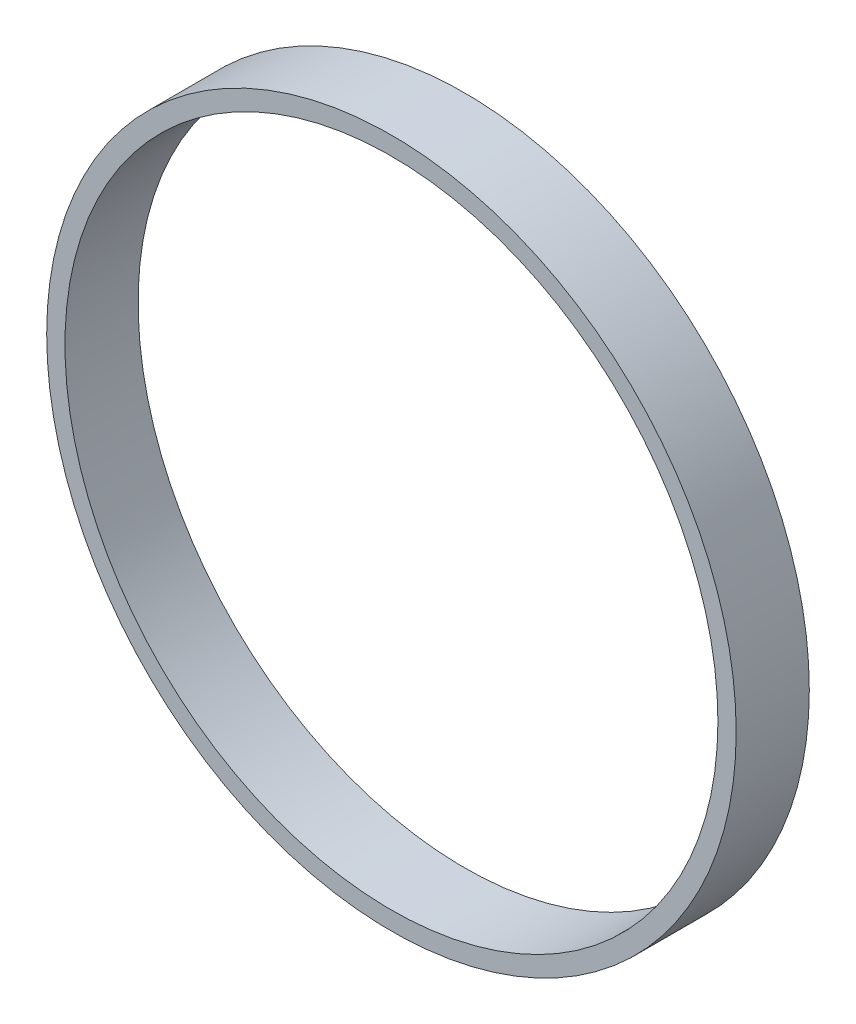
from build123d import *

# Parameters (mm, degrees)
SKETCH1_R           = 33
SKETCH1_R_2         = 31.25
BOSS_EXTRUDE1_DEPTH = 3.5


with BuildPart() as part:
    # Sketch1 → Boss-Extrude1 (new, symmetric)
    with BuildSketch(Plane.XY):
        Circle(SKETCH1_R)
        Circle(SKETCH1_R_2, mode=Mode.SUBTRACT)
    extrude(amount=BOSS_EXTRUDE1_DEPTH, both=True)


solid = part.part
